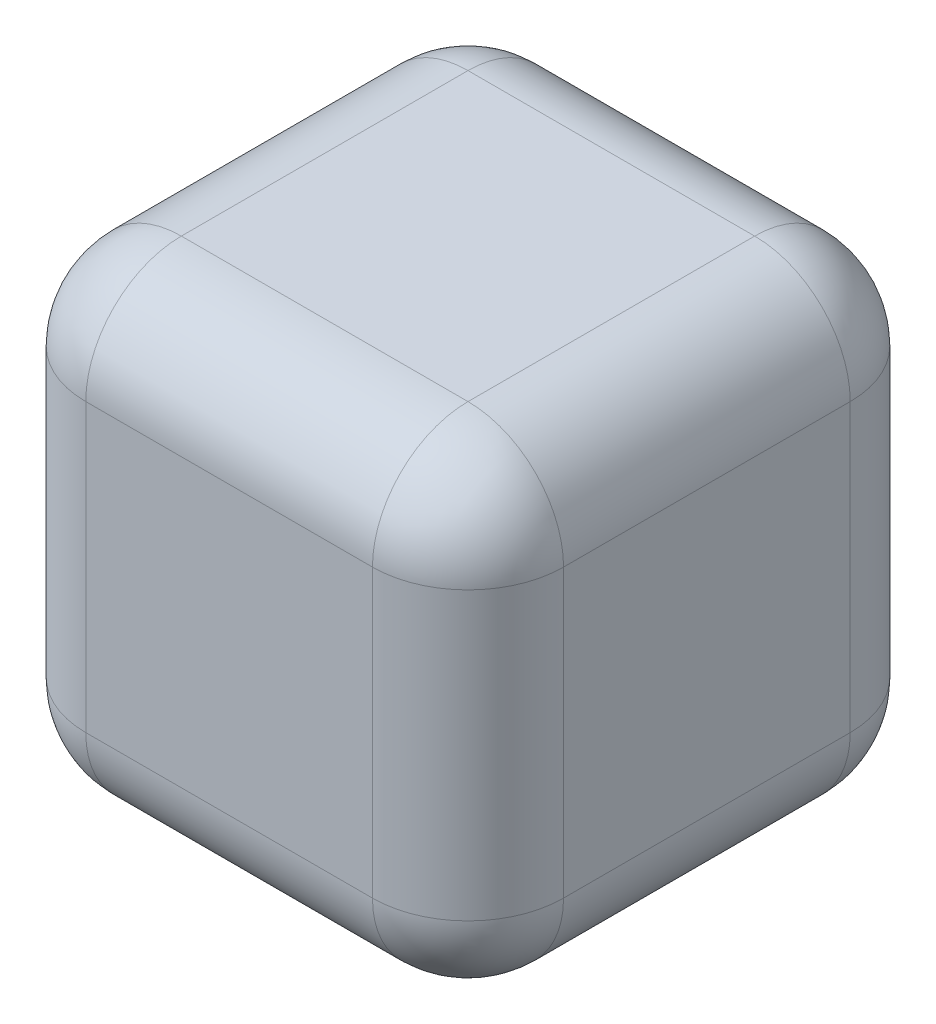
from build123d import *

# Parameters (mm, degrees)
SKETCH1_W           = 10
SKETCH1_H           = 10
BOSS_EXTRUDE1_DEPTH = 10
FILLET1_R           = 2


with BuildPart() as part:
    # Sketch1 → Boss-Extrude1 (new body)
    with BuildSketch(Plane.XY):
        with Locations((5, 5)):
            Rectangle(SKETCH1_W, SKETCH1_H)
    extrude(amount=BOSS_EXTRUDE1_DEPTH)

    # Fillet1
    fillet1_edges = [part.edges().sort_by_distance(p)[0] for p in [
        (10, 5, 10),
        (5, 10, 10),
        (0, 5, 10),
        (5, 10, 0),
        (10, 5, 0),
        (5, 0, 0),
        (0, 5, 0),
        (0, 10, 5),
        (10, 10, 5),
        (10, 0, 5),
        (0, 0, 5),
        (5, 0, 10),
    ]]
    fillet(fillet1_edges, radius=FILLET1_R)


solid = part.part
